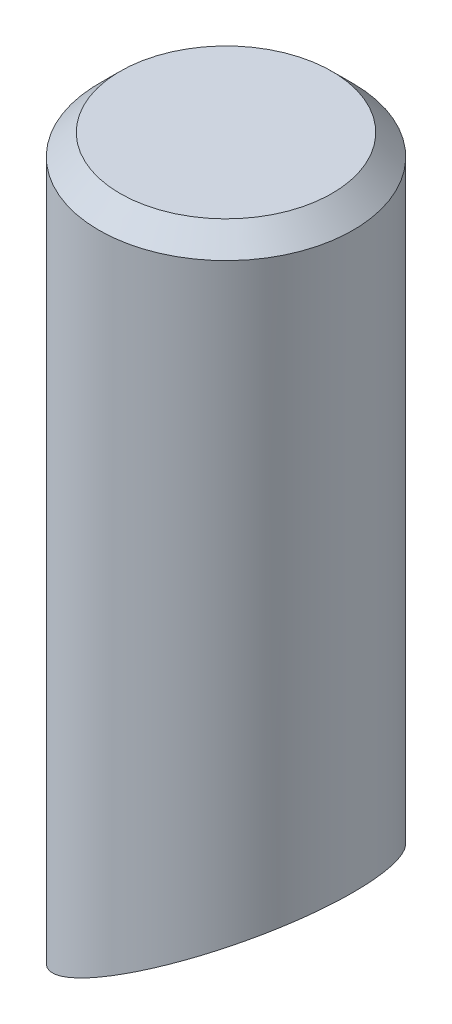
from build123d import *

# Parameters (mm, degrees)
ESQUISSE1_W                  = 12
ESQUISSE1_H                  = 70
ENL_V_MAT_EXTRU_3_DEPTH      = 50
ENL_V_MAT_EXTRU_3_DEPTH_BACK = 100
CHANFREIN1_SIZE              = 2


with BuildPart() as part:
    # Esquisse1 → Base-R_volution (revolve)
    with BuildSketch(Plane.XY, mode=Mode.PRIVATE) as base_r_volution_sk:
        with Locations((6, 35)):
            Rectangle(ESQUISSE1_W, ESQUISSE1_H)
    revolve(base_r_volution_sk.sketch.rotate(Axis((12, 84.859090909, 0), (0, -1, 0)), 270), axis=Axis((12, 84.859090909, 0), (0, -1, 0)))

    # Esquisse2 → Enl_v. mat.-Extru.3 (cut, two sides: drawn at the far end of the back side and taken through both)
    with BuildSketch(Plane.XY.offset(-ENL_V_MAT_EXTRU_3_DEPTH_BACK)):
        Polygon((0, 0), (24, 13.856406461), (24, 0), align=None)
    extrude(amount=ENL_V_MAT_EXTRU_3_DEPTH + ENL_V_MAT_EXTRU_3_DEPTH_BACK, mode=Mode.SUBTRACT)

    # Chanfrein1
    chanfrein1_edges = [part.edges().sort_by_distance(p)[0] for p in [
        (12, 70, -12),
    ]]
    chamfer(chanfrein1_edges, length=CHANFREIN1_SIZE)


solid = part.part
